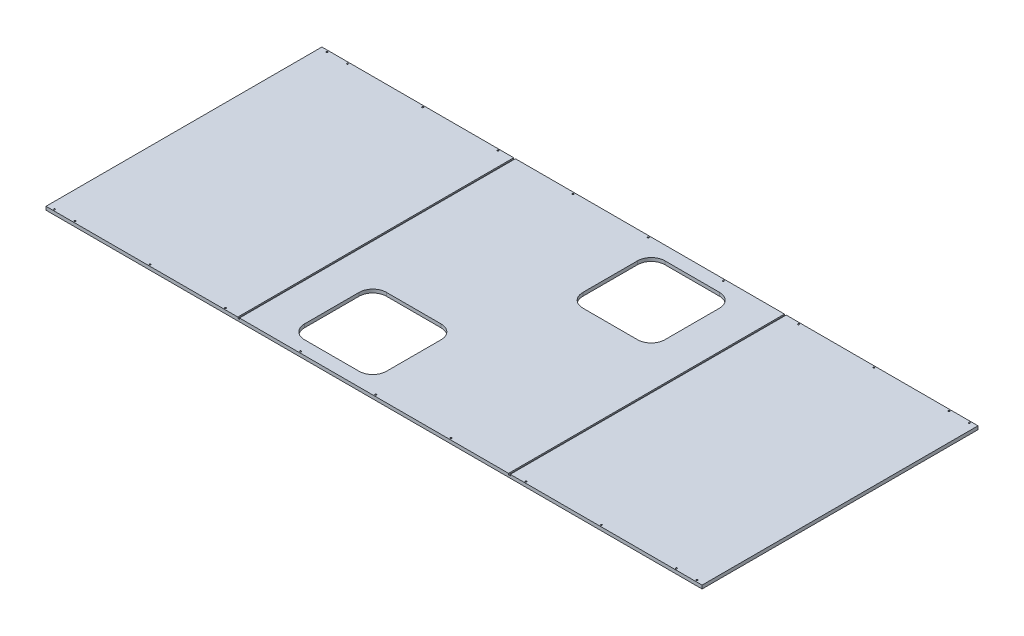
from build123d import *

# Parameters (mm, degrees)
EXTRUDE1_DEPTH     = 12.7
SKETCH2_W          = 6.35
SKETCH2_H          = 1074.181075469
CUT_EXTRUDE1_DEPTH = 4.7625
CUT_EXTRUDE2_DEPTH = 2013.728619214
SKETCH4_R          = 2.8067
EXTRUDE2_DEPTH     = 2013.728619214


with BuildPart() as part:
    # Sketch1 → Extrude1 (new body)
    with BuildSketch(Plane(origin=(0, 0, 0), x_dir=(1, 0, 0), z_dir=(0, 1, 0))):
        Polygon((0, 0), (1025.398, 0), (1731.899, 0), (1731.899, 1025.398), (1025.398, 1025.398), (0, 1025.398), (-706.501, 1025.398), (-706.501, 0), align=None)
    extrude(amount=EXTRUDE1_DEPTH)

    # Sketch2 → Cut-Extrude1 (cut)
    with BuildSketch(Plane(origin=(0, 12.7, 0), x_dir=(1, 0, 0), z_dir=(0, 1, 0))):
        with Locations((9.525, 509.520949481)):
            Rectangle(SKETCH2_W, SKETCH2_H)
        with Locations((1015.873, 509.520949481)):
            Rectangle(SKETCH2_W, SKETCH2_H)
    extrude(amount=-CUT_EXTRUDE1_DEPTH, mode=Mode.SUBTRACT)

    # Sketch3 → Cut-Extrude2 (cut, through all)
    with BuildSketch(Plane.XZ):
        with BuildLine():
            Line((618.998, -669.798), (822.198, -669.798))
            ThreePointArc((822.198, -669.798), (858.119024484, -684.676975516), (872.998, -720.598))
            Line((872.998, -720.598), (872.998, -923.798))
            ThreePointArc((872.998, -923.798), (858.119024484, -959.719024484), (822.198, -974.598))
            Line((822.198, -974.598), (618.998, -974.598))
            ThreePointArc((618.998, -974.598), (583.076975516, -959.719024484), (568.198, -923.798))
            Line((568.198, -923.798), (568.198, -720.598))
            ThreePointArc((568.198, -720.598), (583.076975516, -684.676975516), (618.998, -669.798))
        make_face()
        with BuildLine():
            Line((203.2, -50.8), (406.4, -50.8))
            ThreePointArc((406.4, -50.8), (442.321024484, -65.678975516), (457.2, -101.6))
            Line((457.2, -101.6), (457.2, -304.8))
            ThreePointArc((457.2, -304.8), (442.321024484, -340.721024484), (406.4, -355.6))
            Line((406.4, -355.6), (203.2, -355.6))
            ThreePointArc((203.2, -355.6), (167.278975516, -340.721024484), (152.4, -304.8))
            Line((152.4, -304.8), (152.4, -101.6))
            ThreePointArc((152.4, -101.6), (167.278975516, -65.678975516), (203.2, -50.8))
        make_face()
    extrude(amount=-CUT_EXTRUDE2_DEPTH, mode=Mode.SUBTRACT)

    # Sketch4 → Extrude2 (cut, through all)
    with BuildSketch(Plane.XZ):
        with Locations(Location((1630.299, -6.35, 0), (0, 0, 270))):
            Circle(SKETCH4_R)
        with Locations(Location((1706.499, -1019.048, 0), (0, 0, 90))):
            Circle(SKETCH4_R)
        with Locations(Location((512.699, -1019.048, 0), (0, 0, 90))):
            Circle(SKETCH4_R)
        with Locations(Location((792.099, -1019.048, 0), (0, 0, 90))):
            Circle(SKETCH4_R)
        with Locations(Location((1350.899, -6.35, 0), (0, 0, 270))):
            Circle(SKETCH4_R)
        with Locations(Location((1071.499, -6.35, 0), (0, 0, 270))):
            Circle(SKETCH4_R)
        with Locations(Location((-604.901, -6.35, 0), (0, 0, 270))):
            Circle(SKETCH4_R)
        with Locations(Location((-325.501, -6.35, 0), (0, 0, 270))):
            Circle(SKETCH4_R)
        with Locations(Location((-46.101, -6.35, 0), (0, 0, 270))):
            Circle(SKETCH4_R)
        with Locations(Location((233.299, -6.35, 0), (0, 0, 270))):
            Circle(SKETCH4_R)
        with Locations(Location((-681.101, -6.35, 0), (0, 0, 270))):
            Circle(SKETCH4_R)
        with Locations(Location((792.099, -6.35, 0), (0, 0, 270))):
            Circle(SKETCH4_R)
        with Locations(Location((-681.101, -1019.048, 0), (0, 0, 90))):
            Circle(SKETCH4_R)
        with Locations(Location((233.299, -1019.048, 0), (0, 0, 90))):
            Circle(SKETCH4_R)
        with Locations(Location((-46.101, -1019.048, 0), (0, 0, 90))):
            Circle(SKETCH4_R)
        with Locations(Location((-325.501, -1019.048, 0), (0, 0, 90))):
            Circle(SKETCH4_R)
        with Locations(Location((-604.901, -1019.048, 0), (0, 0, 90))):
            Circle(SKETCH4_R)
        with Locations(Location((1071.499, -1019.048, 0), (0, 0, 90))):
            Circle(SKETCH4_R)
        with Locations(Location((512.699, -6.35, 0), (0, 0, 270))):
            Circle(SKETCH4_R)
        with Locations(Location((1706.499, -6.35, 0), (0, 0, 270))):
            Circle(SKETCH4_R)
        with Locations(Location((1350.899, -1019.048, 0), (0, 0, 90))):
            Circle(SKETCH4_R)
        with Locations(Location((1630.299, -1019.048, 0), (0, 0, 90))):
            Circle(SKETCH4_R)
    extrude(amount=-EXTRUDE2_DEPTH, mode=Mode.SUBTRACT)


solid = part.part
